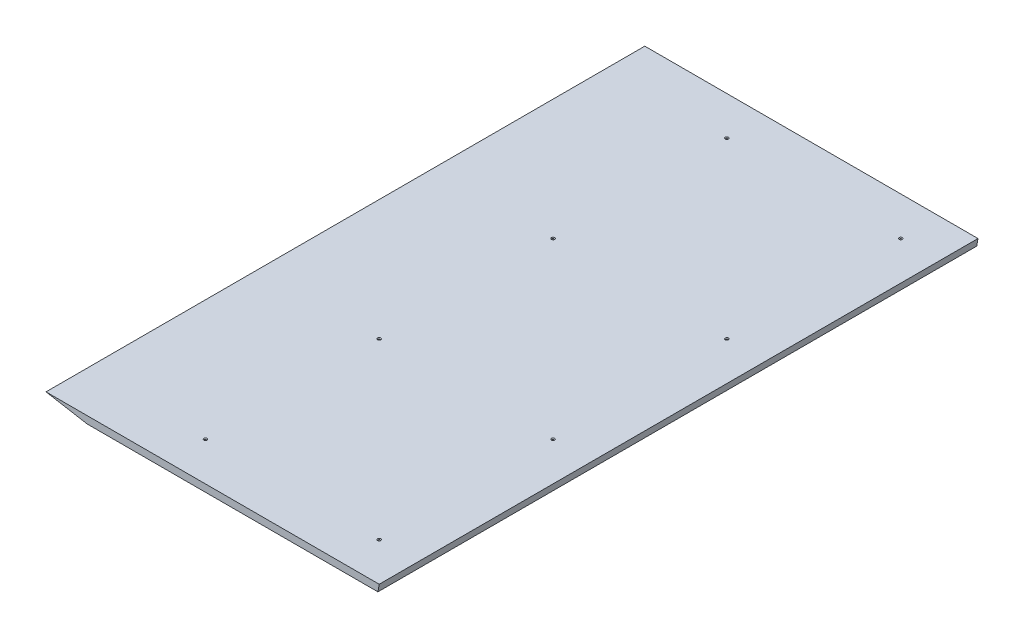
from build123d import *

# Parameters (mm, degrees)
SKETCH1_W                                         = 876.3
SKETCH1_H                                         = 1574.8
BOSS_EXTRUDE1_DEPTH                               = 19.05
CUT_EXTRUDE1_DEPTH                                = 1803.292881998
CSK_FOR_8_FLAT_HEAD_MACHINE_SCREW_100_D           = 4.4958
CSK_FOR_8_FLAT_HEAD_MACHINE_SCREW_100_CSINK_D     = 8.4328
CSK_FOR_8_FLAT_HEAD_MACHINE_SCREW_100_CSINK_ANGLE = 100


with BuildPart() as part:
    # Sketch1 → Boss-Extrude1 (new body)
    with BuildSketch(Plane(origin=(0, 0, 0), x_dir=(1, 0, 0), z_dir=(0, 1, 0))):
        with Locations((438.15, 787.4)):
            Rectangle(SKETCH1_W, SKETCH1_H)
    extrude(amount=BOSS_EXTRUDE1_DEPTH)

    # Sketch2 → Cut-Extrude1 (cut, through all)
    with BuildSketch(Plane.XY):
        Polygon((0, 0), (0, 19.05), (108.037918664, 0), align=None)
        Polygon((876.3, 19.05), (876.3, 0), (872.940971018, 0), align=None)
    extrude(amount=-CUT_EXTRUDE1_DEPTH, mode=Mode.SUBTRACT)

    # CSK for _8 Flat Head Machine Screw _100 (through all)
    with Locations(Plane(origin=(0, 19.05, 0), x_dir=(1, 0, 0), z_dir=(0, 1, 0))):
        with Locations((317.5, 1473.2), (774.7, 1473.2), (774.7, 1016), (774.7, 558.8), (774.7, 101.6), (317.5, 101.6), (317.5, 558.8), (317.5, 1016)):
            CounterSinkHole(CSK_FOR_8_FLAT_HEAD_MACHINE_SCREW_100_D / 2, CSK_FOR_8_FLAT_HEAD_MACHINE_SCREW_100_CSINK_D / 2, counter_sink_angle=CSK_FOR_8_FLAT_HEAD_MACHINE_SCREW_100_CSINK_ANGLE)


solid = part.part
